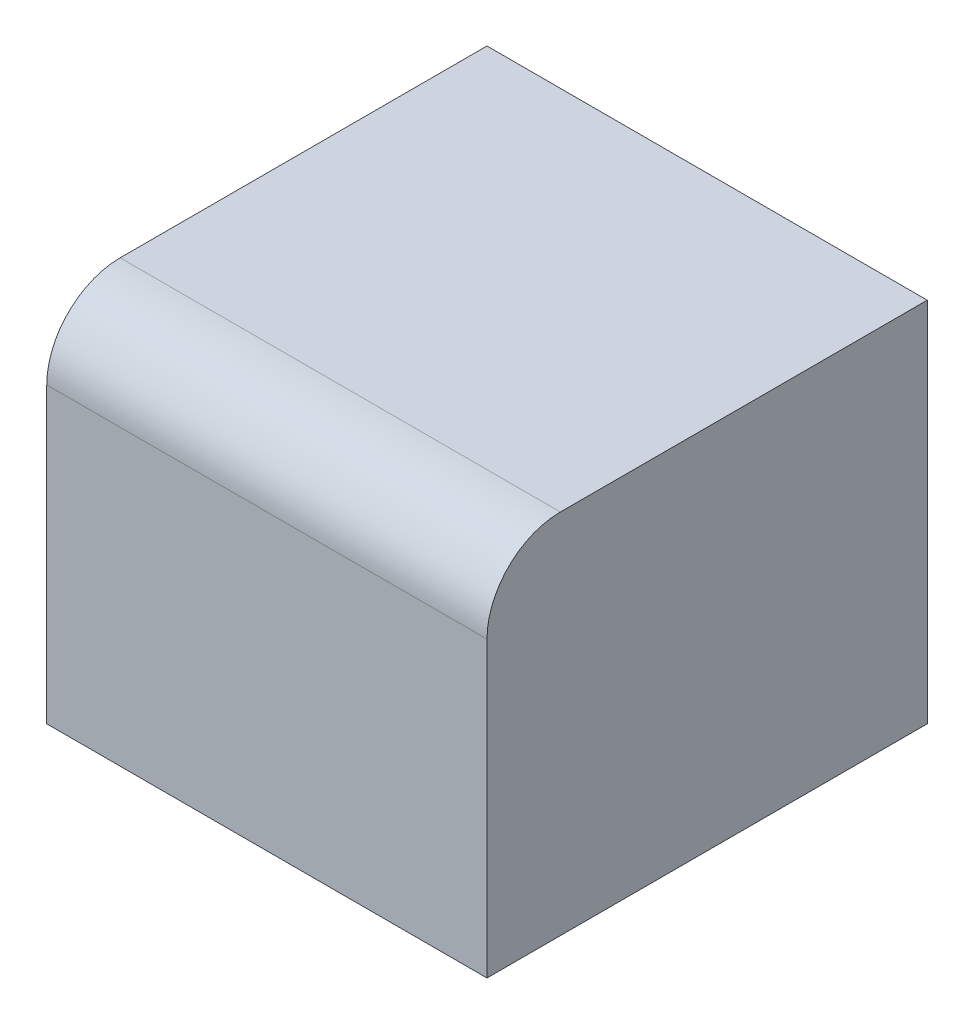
from build123d import *

# Parameters (mm, degrees)
SKETCH1_W           = 60
SKETCH1_H           = 60
BOSS_EXTRUDE1_DEPTH = 50
FILLET1_R           = 10


with BuildPart() as part:
    # Sketch1 → Boss-Extrude1 (new body)
    with BuildSketch(Plane(origin=(0, 0, 0), x_dir=(1, 0, 0), z_dir=(0, 1, 0))):
        Rectangle(SKETCH1_W, SKETCH1_H)
    extrude(amount=BOSS_EXTRUDE1_DEPTH)

    # Fillet1
    fillet1_edges = [part.edges().sort_by_distance(p)[0] for p in [
        (0, 50, 30),
    ]]
    fillet(fillet1_edges, radius=FILLET1_R)


solid = part.part
